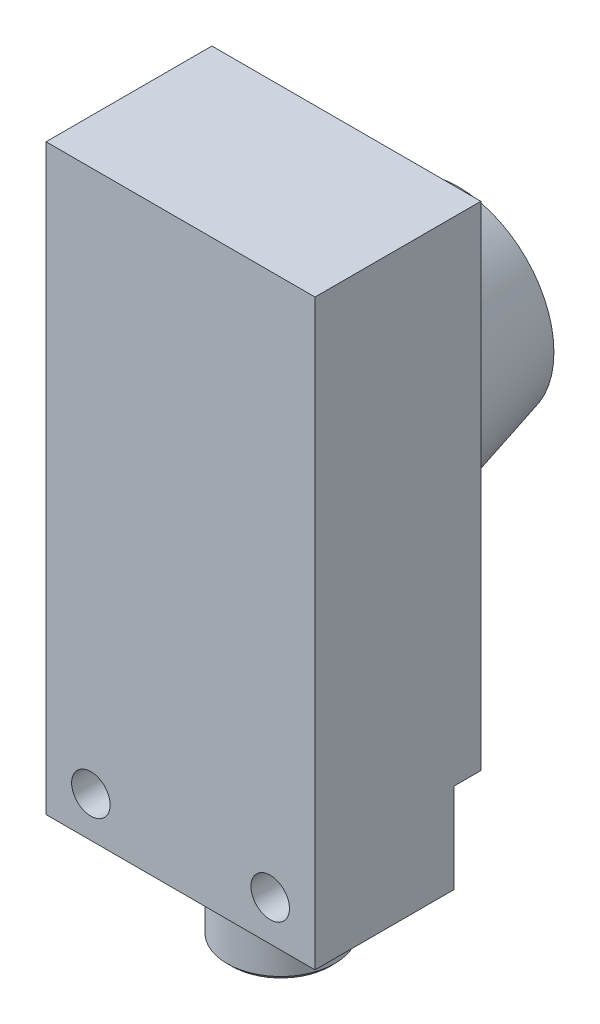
ISO-10303-21;
HEADER;
FILE_DESCRIPTION(('STEP AP214'),'2;1');
FILE_NAME('part.step','',(''),(''),'','','');
FILE_SCHEMA(('AUTOMOTIVE_DESIGN { 1 0 10303 214 1 1 1 1 }'));
ENDSEC;
DATA;
#1=APPLICATION_CONTEXT('core data for automotive mechanical design processes');
#2=APPLICATION_PROTOCOL_DEFINITION('international standard','automotive_design',2000,#1);
#3=PRODUCT_CONTEXT('',#1,'mechanical');
#4=PRODUCT('Part','Part','',(#3));
#5=PRODUCT_RELATED_PRODUCT_CATEGORY('part','',(#4));
#6=PRODUCT_DEFINITION_FORMATION('','',#4);
#7=PRODUCT_DEFINITION_CONTEXT('part definition',#1,'design');
#8=PRODUCT_DEFINITION('design','',#6,#7);
#9=PRODUCT_DEFINITION_SHAPE('','',#8);
#10=(LENGTH_UNIT() NAMED_UNIT(*) SI_UNIT(.MILLI.,.METRE.));
#11=(NAMED_UNIT(*) PLANE_ANGLE_UNIT() SI_UNIT($,.RADIAN.));
#12=(NAMED_UNIT(*) SI_UNIT($,.STERADIAN.) SOLID_ANGLE_UNIT());
#13=UNCERTAINTY_MEASURE_WITH_UNIT(LENGTH_MEASURE(1.E-05),#10,'distance_accuracy_value','');
#14=(GEOMETRIC_REPRESENTATION_CONTEXT(3) GLOBAL_UNCERTAINTY_ASSIGNED_CONTEXT((#13)) GLOBAL_UNIT_ASSIGNED_CONTEXT((#10,
#11,#12)) REPRESENTATION_CONTEXT('',''));
#15=CARTESIAN_POINT('',(0.,0.,0.));
#16=DIRECTION('',(0.,0.,1.));
#17=DIRECTION('',(1.,0.,0.));
#18=AXIS2_PLACEMENT_3D('',#15,#16,#17);
#19=CARTESIAN_POINT('',(-15.,-42.,18.5));
#20=DIRECTION('',(0.,1.,0.));
#21=DIRECTION('',(-1.,0.,0.));
#22=AXIS2_PLACEMENT_3D('',#19,#20,#21);
#23=PLANE('',#22);
#24=DIRECTION('',(-1.,0.,0.));
#25=VECTOR('',#24,1.);
#26=CARTESIAN_POINT('',(-15.,-42.,3.));
#27=LINE('',#26,#25);
#28=CARTESIAN_POINT('',(-4.99999999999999,-42.,3.));
#29=VERTEX_POINT('',#28);
#30=CARTESIAN_POINT('',(-15.,-42.,3.));
#31=VERTEX_POINT('',#30);
#32=EDGE_CURVE('E120',#29,#31,#27,.T.);
#33=ORIENTED_EDGE('',*,*,#32,.F.);
#34=DIRECTION('',(0.,0.,-1.));
#35=VECTOR('',#34,1.);
#36=CARTESIAN_POINT('',(-4.99999999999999,-42.,3.));
#37=LINE('',#36,#35);
#38=CARTESIAN_POINT('',(-4.99999999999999,-42.,0.));
#39=VERTEX_POINT('',#38);
#40=EDGE_CURVE('E403',#29,#39,#37,.T.);
#41=ORIENTED_EDGE('',*,*,#40,.T.);
#42=DIRECTION('',(1.,0.,0.));
#43=VECTOR('',#42,1.);
#44=CARTESIAN_POINT('',(-15.,-42.,0.));
#45=LINE('',#44,#43);
#46=CARTESIAN_POINT('',(5.00000000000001,-42.,0.));
#47=VERTEX_POINT('',#46);
#48=EDGE_CURVE('E136',#39,#47,#45,.T.);
#49=ORIENTED_EDGE('',*,*,#48,.T.);
#50=DIRECTION('',(0.,0.,-1.));
#51=VECTOR('',#50,1.);
#52=CARTESIAN_POINT('',(5.00000000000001,-42.,3.));
#53=LINE('',#52,#51);
#54=CARTESIAN_POINT('',(5.00000000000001,-42.,3.));
#55=VERTEX_POINT('',#54);
#56=EDGE_CURVE('E420',#55,#47,#53,.T.);
#57=ORIENTED_EDGE('',*,*,#56,.F.);
#58=DIRECTION('',(-1.,0.,0.));
#59=VECTOR('',#58,1.);
#60=CARTESIAN_POINT('',(15.,-42.,3.));
#61=LINE('',#60,#59);
#62=CARTESIAN_POINT('',(15.,-42.,3.));
#63=VERTEX_POINT('',#62);
#64=EDGE_CURVE('E414',#63,#55,#61,.T.);
#65=ORIENTED_EDGE('',*,*,#64,.F.);
#66=DIRECTION('',(0.,0.,-1.));
#67=VECTOR('',#66,1.);
#68=CARTESIAN_POINT('',(15.,-42.,18.5));
#69=LINE('',#68,#67);
#70=CARTESIAN_POINT('',(15.,-42.,18.5));
#71=VERTEX_POINT('',#70);
#72=EDGE_CURVE('E162',#71,#63,#69,.T.);
#73=ORIENTED_EDGE('',*,*,#72,.F.);
#74=DIRECTION('',(1.,0.,0.));
#75=VECTOR('',#74,1.);
#76=CARTESIAN_POINT('',(-15.,-42.,18.5));
#77=LINE('',#76,#75);
#78=CARTESIAN_POINT('',(-15.,-42.,18.5));
#79=VERTEX_POINT('',#78);
#80=EDGE_CURVE('E152',#79,#71,#77,.T.);
#81=ORIENTED_EDGE('',*,*,#80,.F.);
#82=DIRECTION('',(0.,0.,-1.));
#83=VECTOR('',#82,1.);
#84=CARTESIAN_POINT('',(-15.,-42.,18.5));
#85=LINE('',#84,#83);
#86=EDGE_CURVE('E165',#79,#31,#85,.T.);
#87=ORIENTED_EDGE('',*,*,#86,.T.);
#88=EDGE_LOOP('',(#33,#41,#49,#57,#65,#73,#81,#87));
#89=FACE_BOUND('',#88,.T.);
#90=CARTESIAN_POINT('',(0.,-42.,7.3));
#91=DIRECTION('',(0.,1.,0.));
#92=DIRECTION('',(-1.,0.,0.));
#93=AXIS2_PLACEMENT_3D('',#90,#91,#92);
#94=CIRCLE('',#93,6.);
#95=CARTESIAN_POINT('',(-5.99999999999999,-42.,7.3));
#96=VERTEX_POINT('',#95);
#97=EDGE_CURVE('E171',#96,#96,#94,.F.);
#98=ORIENTED_EDGE('',*,*,#97,.F.);
#99=EDGE_LOOP('',(#98));
#100=FACE_BOUND('',#99,.T.);
#101=ADVANCED_FACE('F30',(#89,#100),#23,.F.);
#102=CARTESIAN_POINT('',(-15.,23.,0.));
#103=DIRECTION('',(0.,0.,1.));
#104=DIRECTION('',(1.,0.,0.));
#105=AXIS2_PLACEMENT_3D('',#102,#103,#104);
#106=PLANE('',#105);
#107=ORIENTED_EDGE('',*,*,#48,.F.);
#108=DIRECTION('',(0.,-1.,0.));
#109=VECTOR('',#108,1.);
#110=CARTESIAN_POINT('',(-4.99999999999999,-42.,0.));
#111=LINE('',#110,#109);
#112=CARTESIAN_POINT('',(-4.99999999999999,-32.,0.));
#113=VERTEX_POINT('',#112);
#114=EDGE_CURVE('E129',#113,#39,#111,.T.);
#115=ORIENTED_EDGE('',*,*,#114,.F.);
#116=DIRECTION('',(1.,0.,0.));
#117=VECTOR('',#116,1.);
#118=CARTESIAN_POINT('',(-15.,-32.,0.));
#119=LINE('',#118,#117);
#120=CARTESIAN_POINT('',(-15.,-32.,0.));
#121=VERTEX_POINT('',#120);
#122=EDGE_CURVE('E112',#121,#113,#119,.T.);
#123=ORIENTED_EDGE('',*,*,#122,.F.);
#124=DIRECTION('',(0.,-1.,0.));
#125=VECTOR('',#124,1.);
#126=CARTESIAN_POINT('',(-15.,23.,0.));
#127=LINE('',#126,#125);
#128=CARTESIAN_POINT('',(-15.,23.,0.));
#129=VERTEX_POINT('',#128);
#130=EDGE_CURVE('E128',#129,#121,#127,.T.);
#131=ORIENTED_EDGE('',*,*,#130,.F.);
#132=DIRECTION('',(-1.,0.,0.));
#133=VECTOR('',#132,1.);
#134=CARTESIAN_POINT('',(-15.,23.,0.));
#135=LINE('',#134,#133);
#136=CARTESIAN_POINT('',(15.,23.,0.));
#137=VERTEX_POINT('',#136);
#138=EDGE_CURVE('E147',#137,#129,#135,.T.);
#139=ORIENTED_EDGE('',*,*,#138,.F.);
#140=DIRECTION('',(0.,1.,0.));
#141=VECTOR('',#140,1.);
#142=CARTESIAN_POINT('',(15.,23.,0.));
#143=LINE('',#142,#141);
#144=CARTESIAN_POINT('',(15.,-32.,0.));
#145=VERTEX_POINT('',#144);
#146=EDGE_CURVE('E139',#145,#137,#143,.T.);
#147=ORIENTED_EDGE('',*,*,#146,.F.);
#148=DIRECTION('',(1.,0.,0.));
#149=VECTOR('',#148,1.);
#150=CARTESIAN_POINT('',(15.,-32.,0.));
#151=LINE('',#150,#149);
#152=CARTESIAN_POINT('',(5.00000000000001,-32.,0.));
#153=VERTEX_POINT('',#152);
#154=EDGE_CURVE('E410',#153,#145,#151,.T.);
#155=ORIENTED_EDGE('',*,*,#154,.F.);
#156=DIRECTION('',(0.,1.,0.));
#157=VECTOR('',#156,1.);
#158=CARTESIAN_POINT('',(5.00000000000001,-42.,0.));
#159=LINE('',#158,#157);
#160=EDGE_CURVE('E406',#47,#153,#159,.T.);
#161=ORIENTED_EDGE('',*,*,#160,.F.);
#162=EDGE_LOOP('',(#107,#115,#123,#131,#139,#147,#155,#161));
#163=FACE_BOUND('',#162,.T.);
#164=CARTESIAN_POINT('',(0.,0.,0.));
#165=DIRECTION('',(0.,0.,1.));
#166=DIRECTION('',(1.,0.,0.));
#167=AXIS2_PLACEMENT_3D('',#164,#165,#166);
#168=CIRCLE('',#167,14.);
#169=CARTESIAN_POINT('',(14.,0.,0.));
#170=VERTEX_POINT('',#169);
#171=EDGE_CURVE('E168',#170,#170,#168,.F.);
#172=ORIENTED_EDGE('',*,*,#171,.F.);
#173=EDGE_LOOP('',(#172));
#174=FACE_BOUND('',#173,.T.);
#175=ADVANCED_FACE('F125',(#163,#174),#106,.F.);
#176=CARTESIAN_POINT('',(-15.,23.,18.5));
#177=DIRECTION('',(1.,0.,0.));
#178=DIRECTION('',(0.,1.,0.));
#179=AXIS2_PLACEMENT_3D('',#176,#177,#178);
#180=PLANE('',#179);
#181=ORIENTED_EDGE('',*,*,#130,.T.);
#182=DIRECTION('',(0.,0.,-1.));
#183=VECTOR('',#182,1.);
#184=CARTESIAN_POINT('',(-15.,-32.,3.));
#185=LINE('',#184,#183);
#186=CARTESIAN_POINT('',(-15.,-32.,3.));
#187=VERTEX_POINT('',#186);
#188=EDGE_CURVE('E109',#187,#121,#185,.T.);
#189=ORIENTED_EDGE('',*,*,#188,.F.);
#190=DIRECTION('',(0.,1.,0.));
#191=VECTOR('',#190,1.);
#192=CARTESIAN_POINT('',(-15.,-42.,3.));
#193=LINE('',#192,#191);
#194=EDGE_CURVE('E398',#31,#187,#193,.T.);
#195=ORIENTED_EDGE('',*,*,#194,.F.);
#196=ORIENTED_EDGE('',*,*,#86,.F.);
#197=DIRECTION('',(0.,-1.,0.));
#198=VECTOR('',#197,1.);
#199=CARTESIAN_POINT('',(-15.,23.,18.5));
#200=LINE('',#199,#198);
#201=CARTESIAN_POINT('',(-15.,23.,18.5));
#202=VERTEX_POINT('',#201);
#203=EDGE_CURVE('E149',#202,#79,#200,.T.);
#204=ORIENTED_EDGE('',*,*,#203,.F.);
#205=DIRECTION('',(0.,0.,-1.));
#206=VECTOR('',#205,1.);
#207=CARTESIAN_POINT('',(-15.,23.,18.5));
#208=LINE('',#207,#206);
#209=EDGE_CURVE('E135',#202,#129,#208,.T.);
#210=ORIENTED_EDGE('',*,*,#209,.T.);
#211=EDGE_LOOP('',(#181,#189,#195,#196,#204,#210));
#212=FACE_BOUND('',#211,.T.);
#213=ADVANCED_FACE('F32',(#212),#180,.F.);
#214=CARTESIAN_POINT('',(15.,23.,18.5));
#215=DIRECTION('',(-1.,0.,0.));
#216=DIRECTION('',(0.,-1.,0.));
#217=AXIS2_PLACEMENT_3D('',#214,#215,#216);
#218=PLANE('',#217);
#219=DIRECTION('',(0.,-1.,0.));
#220=VECTOR('',#219,1.);
#221=CARTESIAN_POINT('',(15.,-42.,3.));
#222=LINE('',#221,#220);
#223=CARTESIAN_POINT('',(15.,-32.,3.));
#224=VERTEX_POINT('',#223);
#225=EDGE_CURVE('E412',#224,#63,#222,.T.);
#226=ORIENTED_EDGE('',*,*,#225,.F.);
#227=DIRECTION('',(0.,0.,-1.));
#228=VECTOR('',#227,1.);
#229=CARTESIAN_POINT('',(15.,-32.,3.));
#230=LINE('',#229,#228);
#231=EDGE_CURVE('E421',#224,#145,#230,.T.);
#232=ORIENTED_EDGE('',*,*,#231,.T.);
#233=ORIENTED_EDGE('',*,*,#146,.T.);
#234=DIRECTION('',(0.,0.,-1.));
#235=VECTOR('',#234,1.);
#236=CARTESIAN_POINT('',(15.,23.,18.5));
#237=LINE('',#236,#235);
#238=CARTESIAN_POINT('',(15.,23.,18.5));
#239=VERTEX_POINT('',#238);
#240=EDGE_CURVE('E159',#239,#137,#237,.T.);
#241=ORIENTED_EDGE('',*,*,#240,.F.);
#242=DIRECTION('',(0.,1.,0.));
#243=VECTOR('',#242,1.);
#244=CARTESIAN_POINT('',(15.,23.,18.5));
#245=LINE('',#244,#243);
#246=EDGE_CURVE('E154',#71,#239,#245,.T.);
#247=ORIENTED_EDGE('',*,*,#246,.F.);
#248=ORIENTED_EDGE('',*,*,#72,.T.);
#249=EDGE_LOOP('',(#226,#232,#233,#241,#247,#248));
#250=FACE_BOUND('',#249,.T.);
#251=ADVANCED_FACE('F197',(#250),#218,.F.);
#252=CARTESIAN_POINT('',(-15.,23.,18.5));
#253=DIRECTION('',(0.,-1.,0.));
#254=DIRECTION('',(1.,0.,0.));
#255=AXIS2_PLACEMENT_3D('',#252,#253,#254);
#256=PLANE('',#255);
#257=ORIENTED_EDGE('',*,*,#138,.T.);
#258=ORIENTED_EDGE('',*,*,#209,.F.);
#259=DIRECTION('',(-1.,0.,0.));
#260=VECTOR('',#259,1.);
#261=CARTESIAN_POINT('',(-15.,23.,18.5));
#262=LINE('',#261,#260);
#263=EDGE_CURVE('E156',#239,#202,#262,.T.);
#264=ORIENTED_EDGE('',*,*,#263,.F.);
#265=ORIENTED_EDGE('',*,*,#240,.T.);
#266=EDGE_LOOP('',(#257,#258,#264,#265));
#267=FACE_BOUND('',#266,.T.);
#268=ADVANCED_FACE('F200',(#267),#256,.F.);
#269=CARTESIAN_POINT('',(-15.,23.,18.5));
#270=DIRECTION('',(0.,0.,1.));
#271=DIRECTION('',(1.,0.,0.));
#272=AXIS2_PLACEMENT_3D('',#269,#270,#271);
#273=PLANE('',#272);
#274=CARTESIAN_POINT('',(-10.,-37.5,18.5));
#275=DIRECTION('',(0.,0.,1.));
#276=DIRECTION('',(1.,0.,0.));
#277=AXIS2_PLACEMENT_3D('',#274,#275,#276);
#278=CIRCLE('',#277,2.15);
#279=CARTESIAN_POINT('',(-7.85,-37.5,18.5));
#280=VERTEX_POINT('',#279);
#281=EDGE_CURVE('E385',#280,#280,#278,.T.);
#282=ORIENTED_EDGE('',*,*,#281,.F.);
#283=EDGE_LOOP('',(#282));
#284=FACE_BOUND('',#283,.T.);
#285=CARTESIAN_POINT('',(9.99999999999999,-37.5,18.5));
#286=DIRECTION('',(0.,0.,1.));
#287=DIRECTION('',(1.,0.,0.));
#288=AXIS2_PLACEMENT_3D('',#285,#286,#287);
#289=CIRCLE('',#288,2.15);
#290=CARTESIAN_POINT('',(12.15,-37.5,18.5));
#291=VERTEX_POINT('',#290);
#292=EDGE_CURVE('E130',#291,#291,#289,.T.);
#293=ORIENTED_EDGE('',*,*,#292,.F.);
#294=EDGE_LOOP('',(#293));
#295=FACE_BOUND('',#294,.T.);
#296=ORIENTED_EDGE('',*,*,#203,.T.);
#297=ORIENTED_EDGE('',*,*,#80,.T.);
#298=ORIENTED_EDGE('',*,*,#246,.T.);
#299=ORIENTED_EDGE('',*,*,#263,.T.);
#300=EDGE_LOOP('',(#296,#297,#298,#299));
#301=FACE_BOUND('',#300,.T.);
#302=ADVANCED_FACE('F204',(#284,#295,#301),#273,.T.);
#303=CARTESIAN_POINT('',(0.,10.6506350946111,-12.5));
#304=DIRECTION('',(0.,0.,1.));
#305=DIRECTION('',(0.,-1.,0.));
#306=AXIS2_PLACEMENT_3D('',#303,#304,#305);
#307=PLANE('',#306);
#308=CARTESIAN_POINT('',(0.,0.,-12.5));
#309=DIRECTION('',(0.,0.,-1.));
#310=DIRECTION('',(0.,1.,0.));
#311=AXIS2_PLACEMENT_3D('',#308,#309,#310);
#312=CIRCLE('',#311,4.);
#313=CARTESIAN_POINT('',(0.,4.,-12.5));
#314=VERTEX_POINT('',#313);
#315=EDGE_CURVE('E424',#314,#314,#312,.T.);
#316=ORIENTED_EDGE('',*,*,#315,.F.);
#317=EDGE_LOOP('',(#316));
#318=FACE_BOUND('',#317,.T.);
#319=CARTESIAN_POINT('',(0.,0.,-12.5));
#320=DIRECTION('',(0.,0.,1.));
#321=DIRECTION('',(0.,-1.,0.));
#322=AXIS2_PLACEMENT_3D('',#319,#320,#321);
#323=CIRCLE('',#322,10.6506350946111);
#324=CARTESIAN_POINT('',(0.,-10.6506350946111,-12.5));
#325=VERTEX_POINT('',#324);
#326=EDGE_CURVE('E137',#325,#325,#323,.T.);
#327=ORIENTED_EDGE('',*,*,#326,.F.);
#328=EDGE_LOOP('',(#327));
#329=FACE_BOUND('',#328,.T.);
#330=ADVANCED_FACE('F207',(#318,#329),#307,.F.);
#331=CARTESIAN_POINT('',(0.,0.,-12.5));
#332=DIRECTION('',(0.,0.,1.));
#333=DIRECTION('',(0.,-1.,0.));
#334=AXIS2_PLACEMENT_3D('',#331,#332,#333);
#335=CONICAL_SURFACE('',#334,10.6506350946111,0.261799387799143);
#336=ORIENTED_EDGE('',*,*,#171,.T.);
#337=EDGE_LOOP('',(#336));
#338=FACE_BOUND('',#337,.T.);
#339=ORIENTED_EDGE('',*,*,#326,.T.);
#340=EDGE_LOOP('',(#339));
#341=FACE_BOUND('',#340,.T.);
#342=ADVANCED_FACE('F212',(#338,#341),#335,.T.);
#343=CARTESIAN_POINT('',(0.,0.,-12.4));
#344=DIRECTION('',(0.,0.,-1.));
#345=DIRECTION('',(0.,1.,0.));
#346=AXIS2_PLACEMENT_3D('',#343,#344,#345);
#347=CYLINDRICAL_SURFACE('',#346,4.);
#348=CARTESIAN_POINT('',(0.,0.,-12.4));
#349=DIRECTION('',(0.,0.,-1.));
#350=DIRECTION('',(0.,1.,0.));
#351=AXIS2_PLACEMENT_3D('',#348,#349,#350);
#352=CIRCLE('',#351,4.);
#353=CARTESIAN_POINT('',(0.,4.,-12.4));
#354=VERTEX_POINT('',#353);
#355=EDGE_CURVE('E142',#354,#354,#352,.T.);
#356=ORIENTED_EDGE('',*,*,#355,.F.);
#357=EDGE_LOOP('',(#356));
#358=FACE_BOUND('',#357,.T.);
#359=ORIENTED_EDGE('',*,*,#315,.T.);
#360=EDGE_LOOP('',(#359));
#361=FACE_BOUND('',#360,.T.);
#362=ADVANCED_FACE('F216',(#358,#361),#347,.F.);
#363=CARTESIAN_POINT('',(0.,0.,-12.4));
#364=DIRECTION('',(0.,0.,-1.));
#365=DIRECTION('',(0.,1.,0.));
#366=AXIS2_PLACEMENT_3D('',#363,#364,#365);
#367=PLANE('',#366);
#368=ORIENTED_EDGE('',*,*,#355,.T.);
#369=EDGE_LOOP('',(#368));
#370=FACE_BOUND('',#369,.T.);
#371=ADVANCED_FACE('F220',(#370),#367,.T.);
#372=CARTESIAN_POINT('',(15.,-32.,3.));
#373=DIRECTION('',(0.,1.,0.));
#374=DIRECTION('',(0.,0.,1.));
#375=AXIS2_PLACEMENT_3D('',#372,#373,#374);
#376=PLANE('',#375);
#377=ORIENTED_EDGE('',*,*,#154,.T.);
#378=ORIENTED_EDGE('',*,*,#231,.F.);
#379=DIRECTION('',(1.,0.,0.));
#380=VECTOR('',#379,1.);
#381=CARTESIAN_POINT('',(15.,-32.,3.));
#382=LINE('',#381,#380);
#383=CARTESIAN_POINT('',(5.00000000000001,-32.,3.));
#384=VERTEX_POINT('',#383);
#385=EDGE_CURVE('E53',#384,#224,#382,.T.);
#386=ORIENTED_EDGE('',*,*,#385,.F.);
#387=DIRECTION('',(0.,0.,-1.));
#388=VECTOR('',#387,1.);
#389=CARTESIAN_POINT('',(5.00000000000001,-32.,3.));
#390=LINE('',#389,#388);
#391=EDGE_CURVE('E425',#384,#153,#390,.T.);
#392=ORIENTED_EDGE('',*,*,#391,.T.);
#393=EDGE_LOOP('',(#377,#378,#386,#392));
#394=FACE_BOUND('',#393,.T.);
#395=ADVANCED_FACE('F224',(#394),#376,.F.);
#396=CARTESIAN_POINT('',(5.00000000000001,-42.,3.));
#397=DIRECTION('',(-1.,0.,0.));
#398=DIRECTION('',(0.,0.,1.));
#399=AXIS2_PLACEMENT_3D('',#396,#397,#398);
#400=PLANE('',#399);
#401=ORIENTED_EDGE('',*,*,#160,.T.);
#402=ORIENTED_EDGE('',*,*,#391,.F.);
#403=DIRECTION('',(0.,1.,0.));
#404=VECTOR('',#403,1.);
#405=CARTESIAN_POINT('',(5.00000000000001,-42.,3.));
#406=LINE('',#405,#404);
#407=EDGE_CURVE('E417',#55,#384,#406,.T.);
#408=ORIENTED_EDGE('',*,*,#407,.F.);
#409=ORIENTED_EDGE('',*,*,#56,.T.);
#410=EDGE_LOOP('',(#401,#402,#408,#409));
#411=FACE_BOUND('',#410,.T.);
#412=ADVANCED_FACE('F226',(#411),#400,.F.);
#413=CARTESIAN_POINT('',(15.,-32.,3.));
#414=DIRECTION('',(0.,0.,1.));
#415=DIRECTION('',(1.,0.,0.));
#416=AXIS2_PLACEMENT_3D('',#413,#414,#415);
#417=PLANE('',#416);
#418=CARTESIAN_POINT('',(9.99999999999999,-37.5,3.));
#419=DIRECTION('',(0.,0.,-1.));
#420=DIRECTION('',(-1.,0.,0.));
#421=AXIS2_PLACEMENT_3D('',#418,#419,#420);
#422=CIRCLE('',#421,2.15);
#423=CARTESIAN_POINT('',(7.84999999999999,-37.5,3.));
#424=VERTEX_POINT('',#423);
#425=EDGE_CURVE('E390',#424,#424,#422,.T.);
#426=ORIENTED_EDGE('',*,*,#425,.F.);
#427=EDGE_LOOP('',(#426));
#428=FACE_BOUND('',#427,.T.);
#429=ORIENTED_EDGE('',*,*,#225,.T.);
#430=ORIENTED_EDGE('',*,*,#64,.T.);
#431=ORIENTED_EDGE('',*,*,#407,.T.);
#432=ORIENTED_EDGE('',*,*,#385,.T.);
#433=EDGE_LOOP('',(#429,#430,#431,#432));
#434=FACE_BOUND('',#433,.T.);
#435=ADVANCED_FACE('F229',(#428,#434),#417,.F.);
#436=CARTESIAN_POINT('',(-4.99999999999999,-42.,3.));
#437=DIRECTION('',(1.,0.,0.));
#438=DIRECTION('',(0.,0.,-1.));
#439=AXIS2_PLACEMENT_3D('',#436,#437,#438);
#440=PLANE('',#439);
#441=ORIENTED_EDGE('',*,*,#114,.T.);
#442=ORIENTED_EDGE('',*,*,#40,.F.);
#443=DIRECTION('',(0.,-1.,0.));
#444=VECTOR('',#443,1.);
#445=CARTESIAN_POINT('',(-4.99999999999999,-42.,3.));
#446=LINE('',#445,#444);
#447=CARTESIAN_POINT('',(-4.99999999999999,-32.,3.));
#448=VERTEX_POINT('',#447);
#449=EDGE_CURVE('E45',#448,#29,#446,.T.);
#450=ORIENTED_EDGE('',*,*,#449,.F.);
#451=DIRECTION('',(0.,0.,-1.));
#452=VECTOR('',#451,1.);
#453=CARTESIAN_POINT('',(-4.99999999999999,-32.,3.));
#454=LINE('',#453,#452);
#455=EDGE_CURVE('E119',#448,#113,#454,.T.);
#456=ORIENTED_EDGE('',*,*,#455,.T.);
#457=EDGE_LOOP('',(#441,#442,#450,#456));
#458=FACE_BOUND('',#457,.T.);
#459=ADVANCED_FACE('F236',(#458),#440,.F.);
#460=CARTESIAN_POINT('',(-15.,-32.,3.));
#461=DIRECTION('',(0.,1.,0.));
#462=DIRECTION('',(0.,0.,1.));
#463=AXIS2_PLACEMENT_3D('',#460,#461,#462);
#464=PLANE('',#463);
#465=ORIENTED_EDGE('',*,*,#122,.T.);
#466=ORIENTED_EDGE('',*,*,#455,.F.);
#467=DIRECTION('',(1.,0.,0.));
#468=VECTOR('',#467,1.);
#469=CARTESIAN_POINT('',(-15.,-32.,3.));
#470=LINE('',#469,#468);
#471=EDGE_CURVE('E114',#187,#448,#470,.T.);
#472=ORIENTED_EDGE('',*,*,#471,.F.);
#473=ORIENTED_EDGE('',*,*,#188,.T.);
#474=EDGE_LOOP('',(#465,#466,#472,#473));
#475=FACE_BOUND('',#474,.T.);
#476=ADVANCED_FACE('F111',(#475),#464,.F.);
#477=CARTESIAN_POINT('',(-15.,-32.,3.));
#478=DIRECTION('',(0.,0.,-1.));
#479=DIRECTION('',(-1.,0.,0.));
#480=AXIS2_PLACEMENT_3D('',#477,#478,#479);
#481=PLANE('',#480);
#482=CARTESIAN_POINT('',(-10.,-37.5,3.));
#483=DIRECTION('',(0.,0.,-1.));
#484=DIRECTION('',(-1.,0.,0.));
#485=AXIS2_PLACEMENT_3D('',#482,#483,#484);
#486=CIRCLE('',#485,2.15);
#487=CARTESIAN_POINT('',(-12.15,-37.5,3.));
#488=VERTEX_POINT('',#487);
#489=EDGE_CURVE('E388',#488,#488,#486,.T.);
#490=ORIENTED_EDGE('',*,*,#489,.F.);
#491=EDGE_LOOP('',(#490));
#492=FACE_BOUND('',#491,.T.);
#493=ORIENTED_EDGE('',*,*,#194,.T.);
#494=ORIENTED_EDGE('',*,*,#471,.T.);
#495=ORIENTED_EDGE('',*,*,#449,.T.);
#496=ORIENTED_EDGE('',*,*,#32,.T.);
#497=EDGE_LOOP('',(#493,#494,#495,#496));
#498=FACE_BOUND('',#497,.T.);
#499=ADVANCED_FACE('F240',(#492,#498),#481,.T.);
#500=CARTESIAN_POINT('',(9.99999999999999,-37.5,23.));
#501=DIRECTION('',(0.,0.,-1.));
#502=DIRECTION('',(-1.,0.,0.));
#503=AXIS2_PLACEMENT_3D('',#500,#501,#502);
#504=CYLINDRICAL_SURFACE('',#503,2.15);
#505=ORIENTED_EDGE('',*,*,#292,.T.);
#506=EDGE_LOOP('',(#505));
#507=FACE_BOUND('',#506,.T.);
#508=ORIENTED_EDGE('',*,*,#425,.T.);
#509=EDGE_LOOP('',(#508));
#510=FACE_BOUND('',#509,.T.);
#511=ADVANCED_FACE('F246',(#507,#510),#504,.F.);
#512=CARTESIAN_POINT('',(-10.,-37.5,23.));
#513=DIRECTION('',(0.,0.,-1.));
#514=DIRECTION('',(-1.,0.,0.));
#515=AXIS2_PLACEMENT_3D('',#512,#513,#514);
#516=CYLINDRICAL_SURFACE('',#515,2.15);
#517=ORIENTED_EDGE('',*,*,#281,.T.);
#518=EDGE_LOOP('',(#517));
#519=FACE_BOUND('',#518,.T.);
#520=ORIENTED_EDGE('',*,*,#489,.T.);
#521=EDGE_LOOP('',(#520));
#522=FACE_BOUND('',#521,.T.);
#523=ADVANCED_FACE('F250',(#519,#522),#516,.F.);
#524=CARTESIAN_POINT('',(0.,-52.,7.3));
#525=DIRECTION('',(0.,1.,0.));
#526=DIRECTION('',(-1.,0.,0.));
#527=AXIS2_PLACEMENT_3D('',#524,#525,#526);
#528=CYLINDRICAL_SURFACE('',#527,6.);
#529=CARTESIAN_POINT('',(0.,-51.5,7.3));
#530=DIRECTION('',(0.,-1.,0.));
#531=DIRECTION('',(1.,0.,0.));
#532=AXIS2_PLACEMENT_3D('',#529,#530,#531);
#533=CIRCLE('',#532,6.);
#534=CARTESIAN_POINT('',(6.00000000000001,-51.5,7.3));
#535=VERTEX_POINT('',#534);
#536=EDGE_CURVE('E11',#535,#535,#533,.F.);
#537=ORIENTED_EDGE('',*,*,#536,.T.);
#538=EDGE_LOOP('',(#537));
#539=FACE_BOUND('',#538,.T.);
#540=ORIENTED_EDGE('',*,*,#97,.T.);
#541=EDGE_LOOP('',(#540));
#542=FACE_BOUND('',#541,.T.);
#543=ADVANCED_FACE('F185',(#539,#542),#528,.T.);
#544=CARTESIAN_POINT('',(0.,-52.,7.3));
#545=DIRECTION('',(0.,-1.,0.));
#546=DIRECTION('',(1.,0.,0.));
#547=AXIS2_PLACEMENT_3D('',#544,#545,#546);
#548=PLANE('',#547);
#549=CARTESIAN_POINT('',(0.,-52.,7.3));
#550=DIRECTION('',(0.,-1.,0.));
#551=DIRECTION('',(1.,0.,0.));
#552=AXIS2_PLACEMENT_3D('',#549,#550,#551);
#553=CIRCLE('',#552,5.5);
#554=CARTESIAN_POINT('',(5.50000000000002,-52.,7.3));
#555=VERTEX_POINT('',#554);
#556=EDGE_CURVE('E38',#555,#555,#553,.T.);
#557=ORIENTED_EDGE('',*,*,#556,.T.);
#558=EDGE_LOOP('',(#557));
#559=FACE_BOUND('',#558,.T.);
#560=ADVANCED_FACE('F176',(#559),#548,.T.);
#561=CARTESIAN_POINT('',(0.,-52.,7.3));
#562=DIRECTION('',(0.,1.,0.));
#563=DIRECTION('',(-1.,0.,0.));
#564=AXIS2_PLACEMENT_3D('',#561,#562,#563);
#565=CONICAL_SURFACE('',#564,5.5,0.785398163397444);
#566=ORIENTED_EDGE('',*,*,#536,.F.);
#567=EDGE_LOOP('',(#566));
#568=FACE_BOUND('',#567,.T.);
#569=ORIENTED_EDGE('',*,*,#556,.F.);
#570=EDGE_LOOP('',(#569));
#571=FACE_BOUND('',#570,.T.);
#572=ADVANCED_FACE('F178',(#568,#571),#565,.T.);
#573=CLOSED_SHELL('',(#101,#175,#213,#251,#268,#302,#330,#342,#362,#371,#395,#412,#435,#459,
#476,#499,#511,#523,#543,#560,#572));
#574=MANIFOLD_SOLID_BREP('B2',#573);
#575=ADVANCED_BREP_SHAPE_REPRESENTATION('',(#18,#574),#14);
#576=SHAPE_DEFINITION_REPRESENTATION(#9,#575);
ENDSEC;
END-ISO-10303-21;
